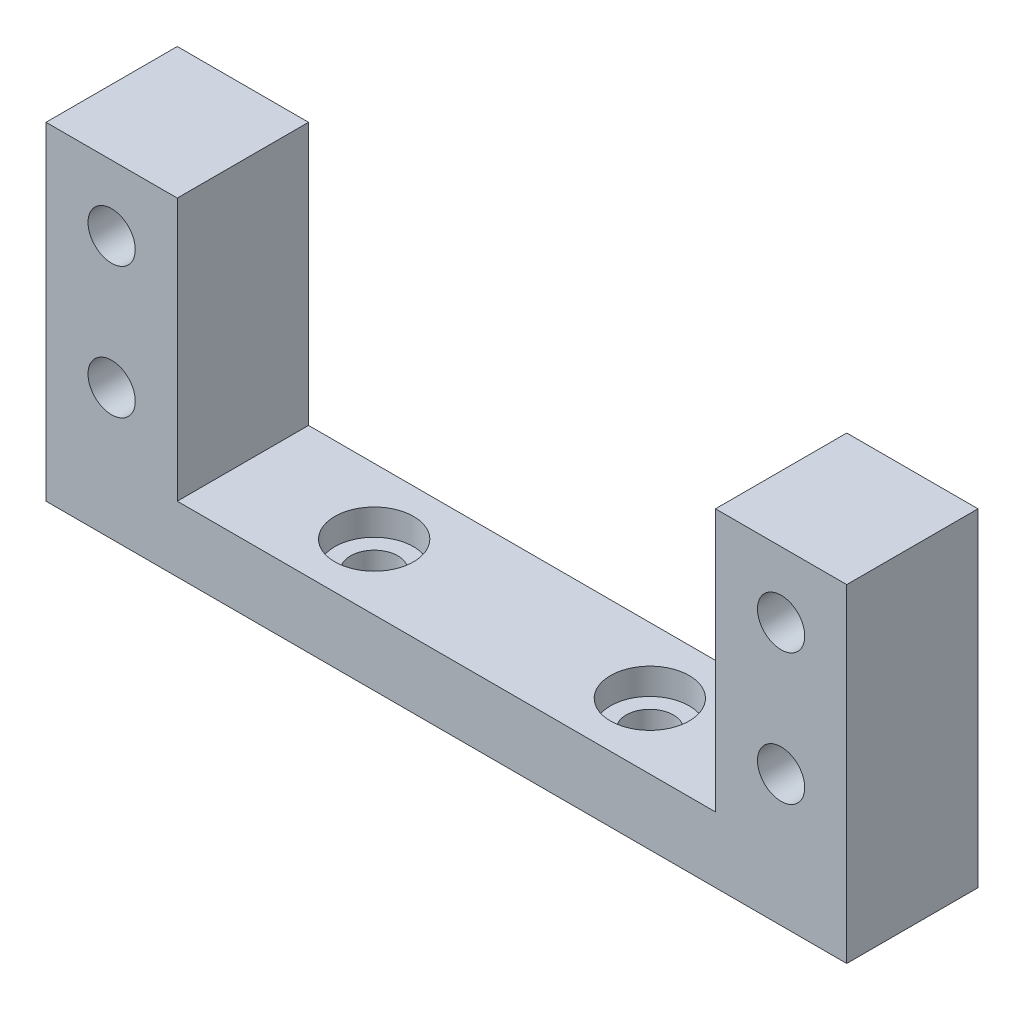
from build123d import *

# Parameters (mm, degrees)
ESQUISSE1_W             = 10
ESQUISSE1_H             = 25
ESQUISSE1_R             = 1.8
ESQUISSE1_W_2           = 41
ESQUISSE1_H_2           = 5
BOSS_EXTRU_1_DEPTH      = 10
ESQUISSE2_R             = 1.8
ENL_V_MAT_EXTRU_1_DEPTH = 10
ESQUISSE3_R             = 3
ENL_V_MAT_EXTRU_2_DEPTH = 2


with BuildPart() as part:
    # Esquisse1 → Boss.-Extru.1 (new body)
    # profile 1 of 3: a face of its own
    with BuildSketch(Plane.XY):
        with Locations((-5, 12.5)):
            Rectangle(ESQUISSE1_W, ESQUISSE1_H)
        with Locations((-5, 10)):
            Circle(ESQUISSE1_R, mode=Mode.SUBTRACT)
        with Locations((-5, 20)):
            Circle(ESQUISSE1_R, mode=Mode.SUBTRACT)
    # profile 2 of 3: a face of its own
    with BuildSketch(Plane.XY):
        with Locations((20.5, 2.5)):
            Rectangle(ESQUISSE1_W_2, ESQUISSE1_H_2)
    # profile 3 of 3: a face of its own
    with BuildSketch(Plane.XY):
        with Locations((46, 12.5)):
            Rectangle(ESQUISSE1_W, ESQUISSE1_H)
        with Locations((46, 10)):
            Circle(ESQUISSE1_R, mode=Mode.SUBTRACT)
        with Locations((46, 20)):
            Circle(ESQUISSE1_R, mode=Mode.SUBTRACT)
    extrude(amount=BOSS_EXTRU_1_DEPTH)

    # Esquisse2 → Enl_v. mat.-Extru.1 (cut)
    with BuildSketch(Plane.XZ):
        with Locations((10, 5)):
            Circle(ESQUISSE2_R)
        with Locations((31, 5)):
            Circle(ESQUISSE2_R)
    extrude(amount=-ENL_V_MAT_EXTRU_1_DEPTH, mode=Mode.SUBTRACT)

    # Esquisse3 → Enl_v. mat.-Extru.2 (cut)
    with BuildSketch(Plane(origin=(0, 5, 0), x_dir=(1, 0, 0), z_dir=(0, 1, 0))):
        with Locations(Location((10, -5, 0), (0, 0, 180))):
            Circle(ESQUISSE3_R)
        with Locations(Location((31, -5, 0), (0, 0, 180))):
            Circle(ESQUISSE3_R)
    extrude(amount=-ENL_V_MAT_EXTRU_2_DEPTH, mode=Mode.SUBTRACT)


solid = part.part
